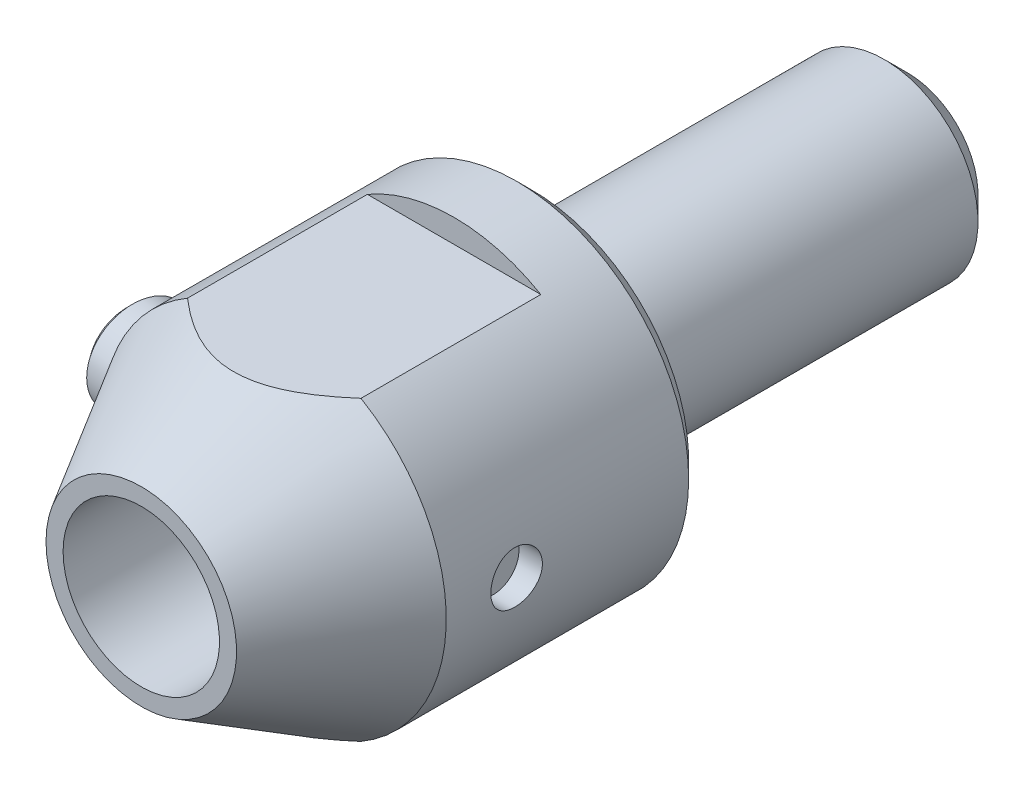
ISO-10303-21;
HEADER;
FILE_DESCRIPTION(('STEP AP214'),'2;1');
FILE_NAME('part.step','',(''),(''),'','','');
FILE_SCHEMA(('AUTOMOTIVE_DESIGN { 1 0 10303 214 1 1 1 1 }'));
ENDSEC;
DATA;
#1=APPLICATION_CONTEXT('core data for automotive mechanical design processes');
#2=APPLICATION_PROTOCOL_DEFINITION('international standard','automotive_design',2000,#1);
#3=PRODUCT_CONTEXT('',#1,'mechanical');
#4=PRODUCT('Part','Part','',(#3));
#5=PRODUCT_RELATED_PRODUCT_CATEGORY('part','',(#4));
#6=PRODUCT_DEFINITION_FORMATION('','',#4);
#7=PRODUCT_DEFINITION_CONTEXT('part definition',#1,'design');
#8=PRODUCT_DEFINITION('design','',#6,#7);
#9=PRODUCT_DEFINITION_SHAPE('','',#8);
#10=(LENGTH_UNIT() NAMED_UNIT(*) SI_UNIT(.MILLI.,.METRE.));
#11=(NAMED_UNIT(*) PLANE_ANGLE_UNIT() SI_UNIT($,.RADIAN.));
#12=(NAMED_UNIT(*) SI_UNIT($,.STERADIAN.) SOLID_ANGLE_UNIT());
#13=UNCERTAINTY_MEASURE_WITH_UNIT(LENGTH_MEASURE(1.E-05),#10,'distance_accuracy_value','');
#14=(GEOMETRIC_REPRESENTATION_CONTEXT(3) GLOBAL_UNCERTAINTY_ASSIGNED_CONTEXT((#13)) GLOBAL_UNIT_ASSIGNED_CONTEXT((#10,
#11,#12)) REPRESENTATION_CONTEXT('',''));
#15=CARTESIAN_POINT('',(0.,0.,0.));
#16=DIRECTION('',(0.,0.,1.));
#17=DIRECTION('',(1.,0.,0.));
#18=AXIS2_PLACEMENT_3D('',#15,#16,#17);
#19=CARTESIAN_POINT('',(0.,0.,-48.3091160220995));
#20=DIRECTION('',(0.,0.,-1.));
#21=DIRECTION('',(-1.,0.,0.));
#22=AXIS2_PLACEMENT_3D('',#19,#20,#21);
#23=CYLINDRICAL_SURFACE('',#22,11.);
#24=CARTESIAN_POINT('',(0.,0.,1.));
#25=DIRECTION('',(0.,0.,-1.));
#26=DIRECTION('',(-1.,0.,0.));
#27=AXIS2_PLACEMENT_3D('',#24,#25,#26);
#28=CIRCLE('',#27,11.);
#29=CARTESIAN_POINT('',(-11.,0.,1.));
#30=VERTEX_POINT('',#29);
#31=EDGE_CURVE('E263',#30,#30,#28,.T.);
#32=ORIENTED_EDGE('',*,*,#31,.F.);
#33=EDGE_LOOP('',(#32));
#34=FACE_BOUND('',#33,.T.);
#35=CARTESIAN_POINT('',(11.,0.,13.65));
#36=CARTESIAN_POINT('',(10.9999985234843,0.0921266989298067,13.6499962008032));
#37=CARTESIAN_POINT('',(10.9988305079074,0.184306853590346,13.6422581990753));
#38=CARTESIAN_POINT('',(10.9942834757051,0.366090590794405,13.611518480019));
#39=CARTESIAN_POINT('',(10.9909023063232,0.455691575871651,13.5885019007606));
#40=CARTESIAN_POINT('',(10.9823089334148,0.629659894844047,13.5279082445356));
#41=CARTESIAN_POINT('',(10.9770981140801,0.714031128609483,13.4903421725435));
#42=CARTESIAN_POINT('',(10.965421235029,0.875259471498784,13.4017427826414));
#43=CARTESIAN_POINT('',(10.9589553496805,0.952117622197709,13.3507113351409));
#44=CARTESIAN_POINT('',(10.945430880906,1.09675139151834,13.2362050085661));
#45=CARTESIAN_POINT('',(10.9383684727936,1.16445981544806,13.172645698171));
#46=CARTESIAN_POINT('',(10.9244768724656,1.28829239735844,13.0350695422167));
#47=CARTESIAN_POINT('',(10.9176476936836,1.34441588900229,12.9610520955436));
#48=CARTESIAN_POINT('',(10.904958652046,1.44374702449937,12.8042092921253));
#49=CARTESIAN_POINT('',(10.8991037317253,1.48688965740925,12.7213423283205));
#50=CARTESIAN_POINT('',(10.8890783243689,1.55861895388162,12.54943589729));
#51=CARTESIAN_POINT('',(10.8849077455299,1.58720641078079,12.4603967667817));
#52=CARTESIAN_POINT('',(10.8787608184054,1.62880518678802,12.2793801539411));
#53=CARTESIAN_POINT('',(10.8767682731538,1.64193154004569,12.1874296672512));
#54=CARTESIAN_POINT('',(10.8751538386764,1.65259186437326,12.002611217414));
#55=CARTESIAN_POINT('',(10.8755318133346,1.65012673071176,11.9097433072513));
#56=CARTESIAN_POINT('',(10.8786009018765,1.62976806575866,11.7265388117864));
#57=CARTESIAN_POINT('',(10.881272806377,1.61200265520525,11.6361876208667));
#58=CARTESIAN_POINT('',(10.88859868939,1.56174829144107,11.4597631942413));
#59=CARTESIAN_POINT('',(10.8932527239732,1.52925892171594,11.3736900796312));
#60=CARTESIAN_POINT('',(10.9040396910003,1.4503456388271,11.2078752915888));
#61=CARTESIAN_POINT('',(10.9101783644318,1.40386745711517,11.1281598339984));
#62=CARTESIAN_POINT('',(10.92323878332,1.2983345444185,10.9776109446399));
#63=CARTESIAN_POINT('',(10.9301605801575,1.23927898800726,10.9067780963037));
#64=CARTESIAN_POINT('',(10.9440922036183,1.10956442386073,10.7752625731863));
#65=CARTESIAN_POINT('',(10.951102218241,1.0387952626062,10.714688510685));
#66=CARTESIAN_POINT('',(10.9643561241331,0.888037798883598,10.606260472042));
#67=CARTESIAN_POINT('',(10.9706000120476,0.808049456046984,10.5584065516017));
#68=CARTESIAN_POINT('',(10.9816246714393,0.641030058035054,10.4767716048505));
#69=CARTESIAN_POINT('',(10.9864045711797,0.553994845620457,10.4429989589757));
#70=CARTESIAN_POINT('',(10.9939553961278,0.375400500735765,10.3905796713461));
#71=CARTESIAN_POINT('',(10.9967264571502,0.28384167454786,10.3719320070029));
#72=CARTESIAN_POINT('',(10.9999293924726,0.0997365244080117,10.3504364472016));
#73=CARTESIAN_POINT('',(11.0003833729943,0.00720800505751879,10.3474392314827));
#74=CARTESIAN_POINT('',(10.9989611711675,-0.177030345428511,10.3569333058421));
#75=CARTESIAN_POINT('',(10.9970850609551,-0.268740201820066,10.3694241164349));
#76=CARTESIAN_POINT('',(10.9912271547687,-0.448285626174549,10.4094155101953));
#77=CARTESIAN_POINT('',(10.9872555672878,-0.536137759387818,10.4368433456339));
#78=CARTESIAN_POINT('',(10.9776505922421,-0.705996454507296,10.5058534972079));
#79=CARTESIAN_POINT('',(10.9720171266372,-0.78800274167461,10.547436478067));
#80=CARTESIAN_POINT('',(10.9596595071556,-0.944498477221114,10.6439268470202));
#81=CARTESIAN_POINT('',(10.9529277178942,-1.01892891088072,10.698928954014));
#82=CARTESIAN_POINT('',(10.9391464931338,-1.15755604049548,10.8205643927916));
#83=CARTESIAN_POINT('',(10.9320970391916,-1.22175214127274,10.8871984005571));
#84=CARTESIAN_POINT('',(10.9184049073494,-1.33863163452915,11.0308708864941));
#85=CARTESIAN_POINT('',(10.9117660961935,-1.39121493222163,11.1079912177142));
#86=CARTESIAN_POINT('',(10.8997154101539,-1.48268042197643,11.2700576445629));
#87=CARTESIAN_POINT('',(10.8943035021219,-1.5215629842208,11.3550035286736));
#88=CARTESIAN_POINT('',(10.8853473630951,-1.58436814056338,11.5300112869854));
#89=CARTESIAN_POINT('',(10.8817965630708,-1.60834340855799,11.6200539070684));
#90=CARTESIAN_POINT('',(10.8769472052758,-1.64082104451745,11.8029449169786));
#91=CARTESIAN_POINT('',(10.8756484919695,-1.64932448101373,11.8957931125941));
#92=CARTESIAN_POINT('',(10.8754561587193,-1.65059165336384,12.0806619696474));
#93=CARTESIAN_POINT('',(10.8765384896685,-1.64351277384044,12.1726815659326));
#94=CARTESIAN_POINT('',(10.8809340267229,-1.61415352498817,12.3542057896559));
#95=CARTESIAN_POINT('',(10.8842472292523,-1.5918731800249,12.4437104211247));
#96=CARTESIAN_POINT('',(10.8927227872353,-1.53279910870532,12.6176203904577));
#97=CARTESIAN_POINT('',(10.8978837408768,-1.49601638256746,12.7020295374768));
#98=CARTESIAN_POINT('',(10.9094750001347,-1.4089973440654,12.8635039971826));
#99=CARTESIAN_POINT('',(10.91590534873,-1.35876057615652,12.940569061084));
#100=CARTESIAN_POINT('',(10.9293881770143,-1.2456877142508,13.0859673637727));
#101=CARTESIAN_POINT('',(10.9364460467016,-1.18273505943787,13.1542094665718));
#102=CARTESIAN_POINT('',(10.950343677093,-1.04626372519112,13.2792170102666));
#103=CARTESIAN_POINT('',(10.9571833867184,-0.972742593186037,13.3359797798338));
#104=CARTESIAN_POINT('',(10.9699170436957,-0.816745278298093,13.4366964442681));
#105=CARTESIAN_POINT('',(10.975805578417,-0.734222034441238,13.4805781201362));
#106=CARTESIAN_POINT('',(10.9859203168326,-0.562927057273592,13.5537923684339));
#107=CARTESIAN_POINT('',(10.9901482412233,-0.474161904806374,13.5831400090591));
#108=CARTESIAN_POINT('',(10.9955003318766,-0.32083230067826,13.6197954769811));
#109=CARTESIAN_POINT('',(10.9971790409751,-0.257214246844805,13.6311048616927));
#110=CARTESIAN_POINT('',(10.9994293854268,-0.129072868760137,13.6462084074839));
#111=CARTESIAN_POINT('',(11.0000010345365,-0.0645495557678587,13.6500026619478));
#112=CARTESIAN_POINT('',(11.,0.,13.65));
#113=B_SPLINE_CURVE_WITH_KNOTS('',3,(#35,#36,#37,#38,#39,#40,#41,#42,#43,#44,#45,#46,#47,#48,
#49,#50,#51,#52,#53,#54,#55,#56,#57,#58,#59,#60,#61,#62,#63,#64,#65,#66,#67,#68,#69,#70,#71,#72,
#73,#74,#75,#76,#77,#78,#79,#80,#81,#82,#83,#84,#85,#86,#87,#88,#89,#90,#91,#92,#93,#94,#95,#96,
#97,#98,#99,#100,#101,#102,#103,#104,#105,#106,#107,#108,#109,#110,#111,#112),.UNSPECIFIED.,.T.,
.F.,(4,2,2,2,2,2,2,2,2,2,2,2,2,2,2,2,2,2,2,2,2,2,2,2,2,2,2,2,2,2,2,2,2,2,2,2,2,2,4),(0.,
0.27614422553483,0.552557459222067,0.828762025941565,1.10492824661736,1.38302357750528,
1.66113489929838,1.94061672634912,2.22008331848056,2.49745721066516,2.7748151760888,
3.04987294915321,3.32493850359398,3.60108521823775,3.87725006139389,4.1561772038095,
4.43510556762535,4.71419969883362,4.99327495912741,5.2696826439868,5.5460817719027,
5.82114663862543,6.09622442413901,6.37330306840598,6.65039782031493,6.92979503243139,
7.20918469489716,7.48758145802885,7.76595899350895,8.0415377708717,8.31711610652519,
8.5924858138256,8.86786484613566,9.14589312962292,9.42398603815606,9.70360955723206,
9.98294256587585,10.1764283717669,10.3699117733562),.UNSPECIFIED.);
#114=CARTESIAN_POINT('',(11.,0.,13.65));
#115=VERTEX_POINT('',#114);
#116=EDGE_CURVE('E182',#115,#115,#113,.T.);
#117=ORIENTED_EDGE('',*,*,#116,.T.);
#118=EDGE_LOOP('',(#117));
#119=FACE_BOUND('',#118,.T.);
#120=CARTESIAN_POINT('',(0.,0.,16.5));
#121=DIRECTION('',(0.,0.,-1.));
#122=DIRECTION('',(-1.,0.,0.));
#123=AXIS2_PLACEMENT_3D('',#120,#121,#122);
#124=CIRCLE('',#123,11.);
#125=CARTESIAN_POINT('',(5.54526825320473,9.5,16.5));
#126=VERTEX_POINT('',#125);
#127=CARTESIAN_POINT('',(5.54526825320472,-9.5,16.5));
#128=VERTEX_POINT('',#127);
#129=EDGE_CURVE('E268',#126,#128,#124,.T.);
#130=ORIENTED_EDGE('',*,*,#129,.T.);
#131=DIRECTION('',(0.,0.,-1.));
#132=VECTOR('',#131,1.);
#133=CARTESIAN_POINT('',(5.54526825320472,-9.5,-48.3091160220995));
#134=LINE('',#133,#132);
#135=CARTESIAN_POINT('',(5.54526825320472,-9.5,5.));
#136=VERTEX_POINT('',#135);
#137=EDGE_CURVE('E36',#128,#136,#134,.T.);
#138=ORIENTED_EDGE('',*,*,#137,.T.);
#139=CARTESIAN_POINT('',(0.,0.,5.));
#140=DIRECTION('',(0.,0.,1.));
#141=DIRECTION('',(1.,0.,0.));
#142=AXIS2_PLACEMENT_3D('',#139,#140,#141);
#143=CIRCLE('',#142,11.);
#144=CARTESIAN_POINT('',(-5.54526825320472,-9.5,5.));
#145=VERTEX_POINT('',#144);
#146=EDGE_CURVE('E238',#145,#136,#143,.T.);
#147=ORIENTED_EDGE('',*,*,#146,.F.);
#148=DIRECTION('',(0.,0.,-1.));
#149=VECTOR('',#148,1.);
#150=CARTESIAN_POINT('',(-5.54526825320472,-9.5,-48.3091160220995));
#151=LINE('',#150,#149);
#152=CARTESIAN_POINT('',(-5.54526825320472,-9.5,16.5));
#153=VERTEX_POINT('',#152);
#154=EDGE_CURVE('E171',#145,#153,#151,.F.);
#155=ORIENTED_EDGE('',*,*,#154,.T.);
#156=CARTESIAN_POINT('',(-5.54526825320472,9.5,16.5));
#157=VERTEX_POINT('',#156);
#158=EDGE_CURVE('E44',#153,#157,#124,.T.);
#159=ORIENTED_EDGE('',*,*,#158,.T.);
#160=DIRECTION('',(0.,0.,-1.));
#161=VECTOR('',#160,1.);
#162=CARTESIAN_POINT('',(-5.54526825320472,9.5,-48.3091160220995));
#163=LINE('',#162,#161);
#164=CARTESIAN_POINT('',(-5.54526825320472,9.5,5.));
#165=VERTEX_POINT('',#164);
#166=EDGE_CURVE('E180',#157,#165,#163,.T.);
#167=ORIENTED_EDGE('',*,*,#166,.T.);
#168=CARTESIAN_POINT('',(0.,0.,5.));
#169=DIRECTION('',(0.,0.,1.));
#170=DIRECTION('',(1.,0.,0.));
#171=AXIS2_PLACEMENT_3D('',#168,#169,#170);
#172=CIRCLE('',#171,11.);
#173=CARTESIAN_POINT('',(5.54526825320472,9.5,5.));
#174=VERTEX_POINT('',#173);
#175=EDGE_CURVE('E239',#174,#165,#172,.T.);
#176=ORIENTED_EDGE('',*,*,#175,.F.);
#177=DIRECTION('',(0.,0.,-1.));
#178=VECTOR('',#177,1.);
#179=CARTESIAN_POINT('',(5.54526825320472,9.5,-48.3091160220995));
#180=LINE('',#179,#178);
#181=EDGE_CURVE('E177',#174,#126,#180,.F.);
#182=ORIENTED_EDGE('',*,*,#181,.T.);
#183=EDGE_LOOP('',(#130,#138,#147,#155,#159,#167,#176,#182));
#184=FACE_BOUND('',#183,.T.);
#185=CARTESIAN_POINT('',(-11.,0.,15.0294827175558));
#186=CARTESIAN_POINT('',(-10.9999973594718,0.167992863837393,15.0294792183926));
#187=CARTESIAN_POINT('',(-10.9961146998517,0.336028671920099,15.0157376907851));
#188=CARTESIAN_POINT('',(-10.9809927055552,0.667340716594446,14.9611240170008));
#189=CARTESIAN_POINT('',(-10.969750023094,0.830614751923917,14.9202395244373));
#190=CARTESIAN_POINT('',(-10.9411247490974,1.14765891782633,14.8124431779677));
#191=CARTESIAN_POINT('',(-10.9237454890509,1.30143415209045,14.7455454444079));
#192=CARTESIAN_POINT('',(-10.8847121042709,1.59531875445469,14.5874220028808));
#193=CARTESIAN_POINT('',(-10.863058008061,1.73542821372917,14.4961964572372));
#194=CARTESIAN_POINT('',(-10.8176869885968,1.99891206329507,14.2910681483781));
#195=CARTESIAN_POINT('',(-10.7939586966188,2.12218332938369,14.1770353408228));
#196=CARTESIAN_POINT('',(-10.7472069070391,2.34751290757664,13.9295127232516));
#197=CARTESIAN_POINT('',(-10.7241833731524,2.44957231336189,13.7960239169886));
#198=CARTESIAN_POINT('',(-10.6816440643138,2.62886756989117,13.5141058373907));
#199=CARTESIAN_POINT('',(-10.6621051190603,2.70627030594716,13.3657863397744));
#200=CARTESIAN_POINT('',(-10.6286247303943,2.83492292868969,13.0576348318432));
#201=CARTESIAN_POINT('',(-10.6146821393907,2.88617817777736,12.8978051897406));
#202=CARTESIAN_POINT('',(-10.5942386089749,2.96033197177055,12.5750816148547));
#203=CARTESIAN_POINT('',(-10.5875764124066,2.98384595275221,12.4123388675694));
#204=CARTESIAN_POINT('',(-10.5817908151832,3.00429993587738,12.0850769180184));
#205=CARTESIAN_POINT('',(-10.5826675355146,3.00123951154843,11.9205576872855));
#206=CARTESIAN_POINT('',(-10.5917267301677,2.96910615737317,11.5938223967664));
#207=CARTESIAN_POINT('',(-10.599931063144,2.93995539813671,11.4316147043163));
#208=CARTESIAN_POINT('',(-10.6226315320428,2.8568400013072,11.1141537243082));
#209=CARTESIAN_POINT('',(-10.6371291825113,2.80286939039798,10.9589021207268));
#210=CARTESIAN_POINT('',(-10.6715664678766,2.66883031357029,10.6522412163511));
#211=CARTESIAN_POINT('',(-10.6917229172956,2.58769014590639,10.5013247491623));
#212=CARTESIAN_POINT('',(-10.7348971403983,2.40229511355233,10.2148429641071));
#213=CARTESIAN_POINT('',(-10.7579158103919,2.29803300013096,10.0792824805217));
#214=CARTESIAN_POINT('',(-10.8052404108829,2.06434157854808,9.82219485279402));
#215=CARTESIAN_POINT('',(-10.82956182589,1.9340994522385,9.70140667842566));
#216=CARTESIAN_POINT('',(-10.8758100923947,1.65433055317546,9.48408743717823));
#217=CARTESIAN_POINT('',(-10.8977372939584,1.50480660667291,9.38755282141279));
#218=CARTESIAN_POINT('',(-10.9360173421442,1.19467088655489,9.22471423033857));
#219=CARTESIAN_POINT('',(-10.9525059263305,1.03447280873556,9.15765747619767));
#220=CARTESIAN_POINT('',(-10.9786813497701,0.704211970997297,9.05301986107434));
#221=CARTESIAN_POINT('',(-10.9883721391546,0.534155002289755,9.01542188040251));
#222=CARTESIAN_POINT('',(-10.9993101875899,0.202031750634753,8.97311226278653));
#223=CARTESIAN_POINT('',(-11.0011077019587,0.0402545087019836,8.96625672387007));
#224=CARTESIAN_POINT('',(-10.9975635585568,-0.282045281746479,8.97988635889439));
#225=CARTESIAN_POINT('',(-10.9922231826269,-0.442568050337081,9.00036662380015));
#226=CARTESIAN_POINT('',(-10.9752915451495,-0.752555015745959,9.06664412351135));
#227=CARTESIAN_POINT('',(-10.9639040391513,-0.9022084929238,9.11161727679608));
#228=CARTESIAN_POINT('',(-10.9361871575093,-1.19207076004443,9.22453482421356));
#229=CARTESIAN_POINT('',(-10.9198569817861,-1.33227801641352,9.29248293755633));
#230=CARTESIAN_POINT('',(-10.8830996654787,-1.60559765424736,9.45226451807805));
#231=CARTESIAN_POINT('',(-10.8625322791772,-1.73818533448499,9.54496121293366));
#232=CARTESIAN_POINT('',(-10.8197935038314,-1.98696548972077,9.74992459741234));
#233=CARTESIAN_POINT('',(-10.7976215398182,-2.10315204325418,9.86219832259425));
#234=CARTESIAN_POINT('',(-10.7522793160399,-2.32424363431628,10.11178267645));
#235=CARTESIAN_POINT('',(-10.7291463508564,-2.42780893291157,10.2502891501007));
#236=CARTESIAN_POINT('',(-10.6860145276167,-2.61112791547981,10.5427309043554));
#237=CARTESIAN_POINT('',(-10.6660163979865,-2.69087606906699,10.6966697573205));
#238=CARTESIAN_POINT('',(-10.6309958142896,-2.82612274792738,11.0204028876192));
#239=CARTESIAN_POINT('',(-10.6161225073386,-2.8809073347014,11.1905133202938));
#240=CARTESIAN_POINT('',(-10.5941133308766,-2.96083005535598,11.5380477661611));
#241=CARTESIAN_POINT('',(-10.5869750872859,-2.98597728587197,11.7154695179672));
#242=CARTESIAN_POINT('',(-10.5816506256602,-3.00478942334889,12.0652953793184));
#243=CARTESIAN_POINT('',(-10.5831315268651,-2.99962493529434,12.2376309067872));
#244=CARTESIAN_POINT('',(-10.5942484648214,-2.96012142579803,12.5786463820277));
#245=CARTESIAN_POINT('',(-10.6038823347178,-2.92579015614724,12.7473272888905));
#246=CARTESIAN_POINT('',(-10.6296035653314,-2.83086555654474,13.0684623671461));
#247=CARTESIAN_POINT('',(-10.6453882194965,-2.77149463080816,13.2213039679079));
#248=CARTESIAN_POINT('',(-10.6816144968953,-2.62840862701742,13.5145231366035));
#249=CARTESIAN_POINT('',(-10.7020561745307,-2.54469326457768,13.6549005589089));
#250=CARTESIAN_POINT('',(-10.7453530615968,-2.35516765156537,13.9196472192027));
#251=CARTESIAN_POINT('',(-10.7682109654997,-2.24933260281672,14.0439982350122));
#252=CARTESIAN_POINT('',(-10.8138540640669,-2.0185086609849,14.2734739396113));
#253=CARTESIAN_POINT('',(-10.8366392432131,-1.89351592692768,14.3785947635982));
#254=CARTESIAN_POINT('',(-10.8802258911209,-1.62469056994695,14.5692331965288));
#255=CARTESIAN_POINT('',(-10.9009706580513,-1.48049499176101,14.6542522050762));
#256=CARTESIAN_POINT('',(-10.9376212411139,-1.17956213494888,14.7993987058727));
#257=CARTESIAN_POINT('',(-10.9535291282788,-1.02283026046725,14.8595368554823));
#258=CARTESIAN_POINT('',(-10.9771415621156,-0.72248592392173,14.9472115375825));
#259=CARTESIAN_POINT('',(-10.9856525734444,-0.579878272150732,14.9780069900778));
#260=CARTESIAN_POINT('',(-10.9970828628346,-0.291524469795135,15.0191438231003));
#261=CARTESIAN_POINT('',(-11.0000022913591,-0.145778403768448,15.0294857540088));
#262=CARTESIAN_POINT('',(-11.,0.,15.0294827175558));
#263=B_SPLINE_CURVE_WITH_KNOTS('',3,(#185,#186,#187,#188,#189,#190,#191,#192,#193,#194,#195,
#196,#197,#198,#199,#200,#201,#202,#203,#204,#205,#206,#207,#208,#209,#210,#211,#212,#213,#214,
#215,#216,#217,#218,#219,#220,#221,#222,#223,#224,#225,#226,#227,#228,#229,#230,#231,#232,#233,
#234,#235,#236,#237,#238,#239,#240,#241,#242,#243,#244,#245,#246,#247,#248,#249,#250,#251,#252,
#253,#254,#255,#256,#257,#258,#259,#260,#261,#262),.UNSPECIFIED.,.T.,.F.,(4,2,2,2,2,2,2,2,2,2,2,
2,2,2,2,2,2,2,2,2,2,2,2,2,2,2,2,2,2,2,2,2,2,2,2,2,2,2,4),(0.,0.503453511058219,1.00713618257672,
1.51054582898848,2.01395211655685,2.52031508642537,3.02665194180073,3.52948508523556,
4.03221506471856,4.52356879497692,5.01493041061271,5.50776269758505,6.00071365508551,
6.51600043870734,7.0314489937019,7.56669493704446,8.10186251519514,8.62243226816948,
9.14269927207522,9.6260555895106,10.1093251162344,10.5772576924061,11.0452660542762,
11.5324154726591,12.0197403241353,12.5408358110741,13.0620522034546,13.5973608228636,
14.1325050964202,14.6471221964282,15.1616025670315,15.6534386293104,16.145280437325,
16.6376766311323,17.1301716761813,17.6338350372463,18.1372824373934,18.5741737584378,
19.0110533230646),.UNSPECIFIED.);
#264=CARTESIAN_POINT('',(-11.,0.,15.0294827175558));
#265=VERTEX_POINT('',#264);
#266=EDGE_CURVE('E10',#265,#265,#263,.T.);
#267=ORIENTED_EDGE('',*,*,#266,.F.);
#268=EDGE_LOOP('',(#267));
#269=FACE_BOUND('',#268,.T.);
#270=ADVANCED_FACE('F16',(#34,#119,#184,#269),#23,.T.);
#271=CARTESIAN_POINT('',(-19.1508082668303,0.,12.));
#272=DIRECTION('',(-1.,0.,0.));
#273=DIRECTION('',(0.,0.,1.));
#274=AXIS2_PLACEMENT_3D('',#271,#272,#273);
#275=CYLINDRICAL_SURFACE('',#274,1.65);
#276=ORIENTED_EDGE('',*,*,#116,.F.);
#277=EDGE_LOOP('',(#276));
#278=FACE_BOUND('',#277,.T.);
#279=CARTESIAN_POINT('',(9.5,0.,12.));
#280=DIRECTION('',(-1.,0.,0.));
#281=DIRECTION('',(0.,0.,1.));
#282=AXIS2_PLACEMENT_3D('',#279,#280,#281);
#283=CIRCLE('',#282,1.65);
#284=CARTESIAN_POINT('',(9.5,0.,13.65));
#285=VERTEX_POINT('',#284);
#286=EDGE_CURVE('E29',#285,#285,#283,.F.);
#287=ORIENTED_EDGE('',*,*,#286,.F.);
#288=EDGE_LOOP('',(#287));
#289=FACE_BOUND('',#288,.T.);
#290=ADVANCED_FACE('F194',(#278,#289),#275,.F.);
#291=CARTESIAN_POINT('',(5.9,0.,0.));
#292=DIRECTION('',(0.,0.,1.));
#293=DIRECTION('',(1.,0.,0.));
#294=AXIS2_PLACEMENT_3D('',#291,#292,#293);
#295=PLANE('',#294);
#296=CARTESIAN_POINT('',(0.,0.,0.));
#297=DIRECTION('',(0.,0.,1.));
#298=DIRECTION('',(1.,0.,0.));
#299=AXIS2_PLACEMENT_3D('',#296,#297,#298);
#300=CIRCLE('',#299,6.);
#301=CARTESIAN_POINT('',(6.,0.,0.));
#302=VERTEX_POINT('',#301);
#303=EDGE_CURVE('E128',#302,#302,#300,.T.);
#304=ORIENTED_EDGE('',*,*,#303,.T.);
#305=EDGE_LOOP('',(#304));
#306=FACE_BOUND('',#305,.T.);
#307=CARTESIAN_POINT('',(0.,0.,0.));
#308=DIRECTION('',(0.,0.,-1.));
#309=DIRECTION('',(-1.,0.,0.));
#310=AXIS2_PLACEMENT_3D('',#307,#308,#309);
#311=CIRCLE('',#310,10.);
#312=CARTESIAN_POINT('',(-10.,0.,0.));
#313=VERTEX_POINT('',#312);
#314=EDGE_CURVE('E490',#313,#313,#311,.T.);
#315=ORIENTED_EDGE('',*,*,#314,.T.);
#316=EDGE_LOOP('',(#315));
#317=FACE_BOUND('',#316,.T.);
#318=ADVANCED_FACE('F199',(#306,#317),#295,.F.);
#319=CARTESIAN_POINT('',(0.,0.,1.));
#320=DIRECTION('',(0.,0.,1.));
#321=DIRECTION('',(1.,0.,0.));
#322=AXIS2_PLACEMENT_3D('',#319,#320,#321);
#323=CONICAL_SURFACE('',#322,11.,0.785398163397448);
#324=ORIENTED_EDGE('',*,*,#314,.F.);
#325=EDGE_LOOP('',(#324));
#326=FACE_BOUND('',#325,.T.);
#327=ORIENTED_EDGE('',*,*,#31,.T.);
#328=EDGE_LOOP('',(#327));
#329=FACE_BOUND('',#328,.T.);
#330=ADVANCED_FACE('F219',(#326,#329),#323,.T.);
#331=CARTESIAN_POINT('',(0.,0.,25.));
#332=DIRECTION('',(0.,0.,-1.));
#333=DIRECTION('',(-1.,0.,0.));
#334=AXIS2_PLACEMENT_3D('',#331,#332,#333);
#335=CONICAL_SURFACE('',#334,6.09252271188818,0.523598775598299);
#336=ORIENTED_EDGE('',*,*,#158,.F.);
#337=CARTESIAN_POINT('',(-14.1807249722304,-9.5,5.98857941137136));
#338=CARTESIAN_POINT('',(-13.8768260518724,-9.5,6.42580027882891));
#339=CARTESIAN_POINT('',(-13.570957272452,-9.5,6.86166688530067));
#340=CARTESIAN_POINT('',(-12.9542967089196,-9.5,7.73002507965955));
#341=CARTESIAN_POINT('',(-12.6435040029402,-9.5,8.16251601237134));
#342=CARTESIAN_POINT('',(-12.0135781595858,-9.5,9.02678684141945));
#343=CARTESIAN_POINT('',(-11.6943977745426,-9.5,9.45853241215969));
#344=CARTESIAN_POINT('',(-11.2102562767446,-9.5,10.1020679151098));
#345=CARTESIAN_POINT('',(-11.0479906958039,-9.5,10.3158863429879));
#346=CARTESIAN_POINT('',(-10.7214469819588,-9.5,10.7420012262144));
#347=CARTESIAN_POINT('',(-10.5571687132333,-9.5,10.9542975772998));
#348=CARTESIAN_POINT('',(-10.0298942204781,-9.5,11.6283733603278));
#349=CARTESIAN_POINT('',(-9.66268980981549,-9.5,12.0868947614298));
#350=CARTESIAN_POINT('',(-9.1016707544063,-9.5,12.766203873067));
#351=CARTESIAN_POINT('',(-8.91296879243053,-9.5,12.9912207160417));
#352=CARTESIAN_POINT('',(-8.53164884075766,-9.5,13.4379073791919));
#353=CARTESIAN_POINT('',(-8.33903097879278,-9.5,13.6595773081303));
#354=CARTESIAN_POINT('',(-7.94995458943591,-9.5,14.0981858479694));
#355=CARTESIAN_POINT('',(-7.75351131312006,-9.5,14.3151379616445));
#356=CARTESIAN_POINT('',(-7.3554449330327,-9.5,14.7442704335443));
#357=CARTESIAN_POINT('',(-7.15382158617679,-9.5,14.9564505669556));
#358=CARTESIAN_POINT('',(-6.74470174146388,-9.5,15.3748170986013));
#359=CARTESIAN_POINT('',(-6.53720915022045,-9.5,15.5810073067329));
#360=CARTESIAN_POINT('',(-6.11525103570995,-9.5,15.9861003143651));
#361=CARTESIAN_POINT('',(-5.90078670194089,-9.5,16.1850043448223));
#362=CARTESIAN_POINT('',(-5.56541970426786,-9.5,16.4831694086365));
#363=CARTESIAN_POINT('',(-5.44743488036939,-9.5,16.5857149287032));
#364=CARTESIAN_POINT('',(-5.2089203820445,-9.5,16.7878017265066));
#365=CARTESIAN_POINT('',(-5.08839066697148,-9.5,16.8873429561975));
#366=CARTESIAN_POINT('',(-4.72252674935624,-9.5,17.1809428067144));
#367=CARTESIAN_POINT('',(-4.47301948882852,-9.5,17.36988610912));
#368=CARTESIAN_POINT('',(-3.96391715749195,-9.5,17.7276535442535));
#369=CARTESIAN_POINT('',(-3.70446103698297,-9.5,17.896673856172));
#370=CARTESIAN_POINT('',(-3.17146086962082,-9.5,18.2108024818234));
#371=CARTESIAN_POINT('',(-2.89793068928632,-9.5,18.3559337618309));
#372=CARTESIAN_POINT('',(-2.46091900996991,-9.5,18.5569579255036));
#373=CARTESIAN_POINT('',(-2.30248845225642,-9.5,18.6238650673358));
#374=CARTESIAN_POINT('',(-1.98124278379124,-9.5,18.7462403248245));
#375=CARTESIAN_POINT('',(-1.81842817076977,-9.5,18.8017097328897));
#376=CARTESIAN_POINT('',(-1.48905448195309,-9.5,18.8995411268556));
#377=CARTESIAN_POINT('',(-1.32249938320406,-9.5,18.9419163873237));
#378=CARTESIAN_POINT('',(-0.98632776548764,-9.5,19.0121524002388));
#379=CARTESIAN_POINT('',(-0.816711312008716,-9.5,19.0400134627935));
#380=CARTESIAN_POINT('',(-0.474167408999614,-9.5,19.0802729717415));
#381=CARTESIAN_POINT('',(-0.301224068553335,-9.5,19.0925378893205));
#382=CARTESIAN_POINT('',(0.0450431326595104,-9.5,19.1006232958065));
#383=CARTESIAN_POINT('',(0.218366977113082,-9.5,19.096444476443));
#384=CARTESIAN_POINT('',(0.563901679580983,-9.5,19.0718271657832));
#385=CARTESIAN_POINT('',(0.736112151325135,-9.5,19.0513833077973));
#386=CARTESIAN_POINT('',(1.07799036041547,-9.5,18.9951061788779));
#387=CARTESIAN_POINT('',(1.24765770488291,-9.5,18.9592705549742));
#388=CARTESIAN_POINT('',(1.62039401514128,-9.5,18.8641231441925));
#389=CARTESIAN_POINT('',(1.82258481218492,-9.5,18.8013783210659));
#390=CARTESIAN_POINT('',(2.22051767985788,-9.5,18.6579368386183));
#391=CARTESIAN_POINT('',(2.41625608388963,-9.5,18.577230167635));
#392=CARTESIAN_POINT('',(2.80135172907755,-9.5,18.4006214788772));
#393=CARTESIAN_POINT('',(2.99068950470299,-9.5,18.3046774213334));
#394=CARTESIAN_POINT('',(3.3625031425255,-9.5,18.100452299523));
#395=CARTESIAN_POINT('',(3.54497958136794,-9.5,17.9921722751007));
#396=CARTESIAN_POINT('',(3.95802467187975,-9.5,17.731065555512));
#397=CARTESIAN_POINT('',(4.18635005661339,-9.5,17.5747033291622));
#398=CARTESIAN_POINT('',(4.63336973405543,-9.5,17.2487059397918));
#399=CARTESIAN_POINT('',(4.85205955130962,-9.5,17.0790647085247));
#400=CARTESIAN_POINT('',(5.28137303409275,-9.5,16.7291447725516));
#401=CARTESIAN_POINT('',(5.49198121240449,-9.5,16.5488471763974));
#402=CARTESIAN_POINT('',(5.9058352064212,-9.5,16.180097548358));
#403=CARTESIAN_POINT('',(6.10908215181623,-9.5,15.9916467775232));
#404=CARTESIAN_POINT('',(6.51191442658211,-9.5,15.6056407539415));
#405=CARTESIAN_POINT('',(6.71141553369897,-9.5,15.4079979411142));
#406=CARTESIAN_POINT('',(7.10483637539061,-9.5,15.0072384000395));
#407=CARTESIAN_POINT('',(7.29875592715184,-9.5,14.8041214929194));
#408=CARTESIAN_POINT('',(7.6815357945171,-9.5,14.3936291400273));
#409=CARTESIAN_POINT('',(7.87040174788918,-9.5,14.1862589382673));
#410=CARTESIAN_POINT('',(8.2439281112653,-9.5,13.7677883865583));
#411=CARTESIAN_POINT('',(8.4285886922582,-9.5,13.5566881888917));
#412=CARTESIAN_POINT('',(8.82675801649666,-9.5,13.0935174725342));
#413=CARTESIAN_POINT('',(9.03955684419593,-9.5,12.8408372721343));
#414=CARTESIAN_POINT('',(9.46078333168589,-9.5,12.3318544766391));
#415=CARTESIAN_POINT('',(9.66921084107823,-9.5,12.0755517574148));
#416=CARTESIAN_POINT('',(10.2888979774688,-9.5,11.3020493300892));
#417=CARTESIAN_POINT('',(10.6945067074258,-9.5,10.7803206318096));
#418=CARTESIAN_POINT('',(11.4944569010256,-9.5,9.72785731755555));
#419=CARTESIAN_POINT('',(11.8887914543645,-9.5,9.19711748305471));
#420=CARTESIAN_POINT('',(12.6684164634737,-9.5,8.12910682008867));
#421=CARTESIAN_POINT('',(13.0537075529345,-9.5,7.5918364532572));
#422=CARTESIAN_POINT('',(13.8181869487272,-9.5,6.5106836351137));
#423=CARTESIAN_POINT('',(14.197354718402,-9.5,5.96678669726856));
#424=CARTESIAN_POINT('',(14.9498309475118,-9.5,4.87494835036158));
#425=CARTESIAN_POINT('',(15.3231393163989,-9.5,4.32700687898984));
#426=CARTESIAN_POINT('',(16.0648034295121,-9.5,3.22806093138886));
#427=CARTESIAN_POINT('',(16.4331608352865,-9.5,2.67705757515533));
#428=CARTESIAN_POINT('',(17.1658551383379,-9.5,1.57238262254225));
#429=CARTESIAN_POINT('',(17.5301920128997,-9.5,1.01871101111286));
#430=CARTESIAN_POINT('',(18.5322186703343,-9.5,-0.51416738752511));
#431=CARTESIAN_POINT('',(19.1663520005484,-9.5,-1.49569874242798));
#432=CARTESIAN_POINT('',(20.4267610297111,-9.5,-3.46391775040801));
#433=CARTESIAN_POINT('',(21.0530359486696,-9.5,-4.45060590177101));
#434=CARTESIAN_POINT('',(22.296150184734,-9.5,-6.42266256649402));
#435=CARTESIAN_POINT('',(22.913021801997,-9.5,-7.40801073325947));
#436=CARTESIAN_POINT('',(23.8346607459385,-9.5,-8.88822948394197));
#437=CARTESIAN_POINT('',(24.1412435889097,-9.5,-9.38197141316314));
#438=CARTESIAN_POINT('',(24.7533175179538,-9.5,-10.3701302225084));
#439=CARTESIAN_POINT('',(25.0588086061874,-9.5,-10.8645471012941));
#440=CARTESIAN_POINT('',(25.3638135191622,-9.5,-11.3592638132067));
#441=B_SPLINE_CURVE_WITH_KNOTS('',3,(#337,#338,#339,#340,#341,#342,#343,#344,#345,#346,#347,
#348,#349,#350,#351,#352,#353,#354,#355,#356,#357,#358,#359,#360,#361,#362,#363,#364,#365,#366,
#367,#368,#369,#370,#371,#372,#373,#374,#375,#376,#377,#378,#379,#380,#381,#382,#383,#384,#385,
#386,#387,#388,#389,#390,#391,#392,#393,#394,#395,#396,#397,#398,#399,#400,#401,#402,#403,#404,
#405,#406,#407,#408,#409,#410,#411,#412,#413,#414,#415,#416,#417,#418,#419,#420,#421,#422,#423,
#424,#425,#426,#427,#428,#429,#430,#431,#432,#433,#434,#435,#436,#437,#438,#439,#440),
.UNSPECIFIED.,.F.,.F.,(4,2,2,2,2,2,2,2,2,2,2,2,2,2,2,2,2,2,2,2,2,2,2,2,2,2,2,2,2,2,2,2,2,2,2,2,
2,2,2,2,2,2,2,2,2,2,2,2,2,2,2,4),(0.,1.59740058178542,3.19510385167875,4.80578789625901,
5.61103158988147,6.41632992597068,8.17838822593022,9.05935862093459,9.94030032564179,
10.8182526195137,11.6962461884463,12.57366850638,13.4509418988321,13.9198572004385,
14.3887799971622,15.3270354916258,16.2551033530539,17.1822737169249,17.6978508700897,
18.2133697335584,18.7283642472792,19.2433477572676,19.7627113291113,20.2820530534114,
20.801566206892,21.3211588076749,21.9552457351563,22.5896869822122,23.2259100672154,
23.8620795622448,24.6916401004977,25.5215819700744,26.3530420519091,27.1843739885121,
28.026723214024,28.8690999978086,29.7104941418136,30.551854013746,31.5428413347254,
32.5338626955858,34.5161623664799,36.4996520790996,38.4830023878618,40.4720086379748,
42.4610455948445,44.4493974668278,46.4377605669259,49.9433789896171,53.4493426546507,
56.9368693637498,58.6804184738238,60.4239641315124),.UNSPECIFIED.);
#442=EDGE_CURVE('E231',#153,#128,#441,.T.);
#443=ORIENTED_EDGE('',*,*,#442,.T.);
#444=ORIENTED_EDGE('',*,*,#129,.F.);
#445=CARTESIAN_POINT('',(-14.1807249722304,9.5,5.98857941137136));
#446=CARTESIAN_POINT('',(-13.8768260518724,9.5,6.42580027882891));
#447=CARTESIAN_POINT('',(-13.570957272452,9.5,6.86166688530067));
#448=CARTESIAN_POINT('',(-12.9542967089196,9.5,7.73002507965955));
#449=CARTESIAN_POINT('',(-12.6435040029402,9.5,8.16251601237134));
#450=CARTESIAN_POINT('',(-12.0135781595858,9.5,9.02678684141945));
#451=CARTESIAN_POINT('',(-11.6943977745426,9.5,9.45853241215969));
#452=CARTESIAN_POINT('',(-11.2102562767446,9.5,10.1020679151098));
#453=CARTESIAN_POINT('',(-11.0479906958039,9.5,10.3158863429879));
#454=CARTESIAN_POINT('',(-10.7214469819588,9.5,10.7420012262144));
#455=CARTESIAN_POINT('',(-10.5571687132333,9.5,10.9542975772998));
#456=CARTESIAN_POINT('',(-10.0298942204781,9.5,11.6283733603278));
#457=CARTESIAN_POINT('',(-9.66268980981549,9.5,12.0868947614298));
#458=CARTESIAN_POINT('',(-9.1016707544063,9.5,12.766203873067));
#459=CARTESIAN_POINT('',(-8.91296879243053,9.5,12.9912207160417));
#460=CARTESIAN_POINT('',(-8.53164884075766,9.5,13.4379073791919));
#461=CARTESIAN_POINT('',(-8.33903097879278,9.5,13.6595773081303));
#462=CARTESIAN_POINT('',(-7.94995458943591,9.5,14.0981858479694));
#463=CARTESIAN_POINT('',(-7.75351131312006,9.5,14.3151379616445));
#464=CARTESIAN_POINT('',(-7.3554449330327,9.5,14.7442704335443));
#465=CARTESIAN_POINT('',(-7.15382158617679,9.5,14.9564505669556));
#466=CARTESIAN_POINT('',(-6.74470174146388,9.5,15.3748170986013));
#467=CARTESIAN_POINT('',(-6.53720915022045,9.5,15.5810073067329));
#468=CARTESIAN_POINT('',(-6.11525103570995,9.5,15.9861003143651));
#469=CARTESIAN_POINT('',(-5.90078670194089,9.5,16.1850043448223));
#470=CARTESIAN_POINT('',(-5.56541970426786,9.5,16.4831694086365));
#471=CARTESIAN_POINT('',(-5.44743488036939,9.5,16.5857149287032));
#472=CARTESIAN_POINT('',(-5.2089203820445,9.5,16.7878017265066));
#473=CARTESIAN_POINT('',(-5.08839066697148,9.5,16.8873429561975));
#474=CARTESIAN_POINT('',(-4.72252674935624,9.5,17.1809428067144));
#475=CARTESIAN_POINT('',(-4.47301948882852,9.5,17.36988610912));
#476=CARTESIAN_POINT('',(-3.96391715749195,9.5,17.7276535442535));
#477=CARTESIAN_POINT('',(-3.70446103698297,9.5,17.896673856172));
#478=CARTESIAN_POINT('',(-3.17146086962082,9.5,18.2108024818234));
#479=CARTESIAN_POINT('',(-2.89793068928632,9.5,18.3559337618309));
#480=CARTESIAN_POINT('',(-2.46091900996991,9.5,18.5569579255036));
#481=CARTESIAN_POINT('',(-2.30248845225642,9.5,18.6238650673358));
#482=CARTESIAN_POINT('',(-1.98124278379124,9.5,18.7462403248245));
#483=CARTESIAN_POINT('',(-1.81842817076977,9.5,18.8017097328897));
#484=CARTESIAN_POINT('',(-1.48905448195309,9.5,18.8995411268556));
#485=CARTESIAN_POINT('',(-1.32249938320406,9.5,18.9419163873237));
#486=CARTESIAN_POINT('',(-0.98632776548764,9.5,19.0121524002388));
#487=CARTESIAN_POINT('',(-0.816711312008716,9.5,19.0400134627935));
#488=CARTESIAN_POINT('',(-0.474167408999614,9.5,19.0802729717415));
#489=CARTESIAN_POINT('',(-0.301224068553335,9.5,19.0925378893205));
#490=CARTESIAN_POINT('',(0.0450431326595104,9.5,19.1006232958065));
#491=CARTESIAN_POINT('',(0.218366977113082,9.5,19.096444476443));
#492=CARTESIAN_POINT('',(0.563901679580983,9.5,19.0718271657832));
#493=CARTESIAN_POINT('',(0.736112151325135,9.5,19.0513833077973));
#494=CARTESIAN_POINT('',(1.07799036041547,9.5,18.9951061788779));
#495=CARTESIAN_POINT('',(1.24765770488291,9.5,18.9592705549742));
#496=CARTESIAN_POINT('',(1.62039401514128,9.5,18.8641231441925));
#497=CARTESIAN_POINT('',(1.82258481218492,9.5,18.8013783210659));
#498=CARTESIAN_POINT('',(2.22051767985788,9.5,18.6579368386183));
#499=CARTESIAN_POINT('',(2.41625608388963,9.5,18.577230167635));
#500=CARTESIAN_POINT('',(2.80135172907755,9.5,18.4006214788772));
#501=CARTESIAN_POINT('',(2.99068950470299,9.5,18.3046774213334));
#502=CARTESIAN_POINT('',(3.3625031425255,9.5,18.100452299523));
#503=CARTESIAN_POINT('',(3.54497958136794,9.5,17.9921722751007));
#504=CARTESIAN_POINT('',(3.95802467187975,9.5,17.731065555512));
#505=CARTESIAN_POINT('',(4.18635005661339,9.5,17.5747033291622));
#506=CARTESIAN_POINT('',(4.63336973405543,9.5,17.2487059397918));
#507=CARTESIAN_POINT('',(4.85205955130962,9.5,17.0790647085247));
#508=CARTESIAN_POINT('',(5.28137303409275,9.5,16.7291447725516));
#509=CARTESIAN_POINT('',(5.49198121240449,9.5,16.5488471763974));
#510=CARTESIAN_POINT('',(5.9058352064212,9.5,16.180097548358));
#511=CARTESIAN_POINT('',(6.10908215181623,9.5,15.9916467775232));
#512=CARTESIAN_POINT('',(6.51191442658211,9.5,15.6056407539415));
#513=CARTESIAN_POINT('',(6.71141553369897,9.5,15.4079979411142));
#514=CARTESIAN_POINT('',(7.10483637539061,9.5,15.0072384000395));
#515=CARTESIAN_POINT('',(7.29875592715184,9.5,14.8041214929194));
#516=CARTESIAN_POINT('',(7.6815357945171,9.5,14.3936291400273));
#517=CARTESIAN_POINT('',(7.87040174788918,9.5,14.1862589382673));
#518=CARTESIAN_POINT('',(8.2439281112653,9.5,13.7677883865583));
#519=CARTESIAN_POINT('',(8.4285886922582,9.5,13.5566881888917));
#520=CARTESIAN_POINT('',(8.82675801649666,9.5,13.0935174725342));
#521=CARTESIAN_POINT('',(9.03955684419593,9.5,12.8408372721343));
#522=CARTESIAN_POINT('',(9.46078333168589,9.5,12.3318544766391));
#523=CARTESIAN_POINT('',(9.66921084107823,9.5,12.0755517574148));
#524=CARTESIAN_POINT('',(10.2888979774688,9.5,11.3020493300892));
#525=CARTESIAN_POINT('',(10.6945067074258,9.5,10.7803206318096));
#526=CARTESIAN_POINT('',(11.4944569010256,9.5,9.72785731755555));
#527=CARTESIAN_POINT('',(11.8887914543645,9.5,9.19711748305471));
#528=CARTESIAN_POINT('',(12.6684164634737,9.5,8.12910682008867));
#529=CARTESIAN_POINT('',(13.0537075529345,9.5,7.5918364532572));
#530=CARTESIAN_POINT('',(13.8181869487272,9.5,6.5106836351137));
#531=CARTESIAN_POINT('',(14.197354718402,9.5,5.96678669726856));
#532=CARTESIAN_POINT('',(14.9498309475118,9.5,4.87494835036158));
#533=CARTESIAN_POINT('',(15.3231393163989,9.5,4.32700687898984));
#534=CARTESIAN_POINT('',(16.0648034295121,9.5,3.22806093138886));
#535=CARTESIAN_POINT('',(16.4331608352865,9.5,2.67705757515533));
#536=CARTESIAN_POINT('',(17.1658551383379,9.5,1.57238262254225));
#537=CARTESIAN_POINT('',(17.5301920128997,9.5,1.01871101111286));
#538=CARTESIAN_POINT('',(18.5322186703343,9.5,-0.51416738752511));
#539=CARTESIAN_POINT('',(19.1663520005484,9.5,-1.49569874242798));
#540=CARTESIAN_POINT('',(20.4267610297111,9.5,-3.46391775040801));
#541=CARTESIAN_POINT('',(21.0530359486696,9.5,-4.45060590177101));
#542=CARTESIAN_POINT('',(22.296150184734,9.5,-6.42266256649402));
#543=CARTESIAN_POINT('',(22.913021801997,9.5,-7.40801073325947));
#544=CARTESIAN_POINT('',(23.8346607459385,9.5,-8.88822948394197));
#545=CARTESIAN_POINT('',(24.1412435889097,9.5,-9.38197141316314));
#546=CARTESIAN_POINT('',(24.7533175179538,9.5,-10.3701302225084));
#547=CARTESIAN_POINT('',(25.0588086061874,9.5,-10.8645471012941));
#548=CARTESIAN_POINT('',(25.3638135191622,9.5,-11.3592638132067));
#549=B_SPLINE_CURVE_WITH_KNOTS('',3,(#445,#446,#447,#448,#449,#450,#451,#452,#453,#454,#455,
#456,#457,#458,#459,#460,#461,#462,#463,#464,#465,#466,#467,#468,#469,#470,#471,#472,#473,#474,
#475,#476,#477,#478,#479,#480,#481,#482,#483,#484,#485,#486,#487,#488,#489,#490,#491,#492,#493,
#494,#495,#496,#497,#498,#499,#500,#501,#502,#503,#504,#505,#506,#507,#508,#509,#510,#511,#512,
#513,#514,#515,#516,#517,#518,#519,#520,#521,#522,#523,#524,#525,#526,#527,#528,#529,#530,#531,
#532,#533,#534,#535,#536,#537,#538,#539,#540,#541,#542,#543,#544,#545,#546,#547,#548),
.UNSPECIFIED.,.F.,.F.,(4,2,2,2,2,2,2,2,2,2,2,2,2,2,2,2,2,2,2,2,2,2,2,2,2,2,2,2,2,2,2,2,2,2,2,2,
2,2,2,2,2,2,2,2,2,2,2,2,2,2,2,4),(0.,1.59740058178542,3.19510385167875,4.80578789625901,
5.61103158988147,6.41632992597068,8.17838822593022,9.05935862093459,9.94030032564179,
10.8182526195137,11.6962461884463,12.57366850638,13.4509418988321,13.9198572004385,
14.3887799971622,15.3270354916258,16.2551033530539,17.1822737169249,17.6978508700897,
18.2133697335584,18.7283642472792,19.2433477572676,19.7627113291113,20.2820530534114,
20.801566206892,21.3211588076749,21.9552457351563,22.5896869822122,23.2259100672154,
23.8620795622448,24.6916401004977,25.5215819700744,26.3530420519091,27.1843739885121,
28.026723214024,28.8690999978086,29.7104941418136,30.551854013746,31.5428413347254,
32.5338626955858,34.5161623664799,36.4996520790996,38.4830023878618,40.4720086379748,
42.4610455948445,44.4493974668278,46.4377605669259,49.9433789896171,53.4493426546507,
56.9368693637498,58.6804184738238,60.4239641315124),.UNSPECIFIED.);
#550=EDGE_CURVE('E223',#126,#157,#549,.F.);
#551=ORIENTED_EDGE('',*,*,#550,.T.);
#552=EDGE_LOOP('',(#336,#443,#444,#551));
#553=FACE_BOUND('',#552,.T.);
#554=CARTESIAN_POINT('',(0.,0.,25.));
#555=DIRECTION('',(0.,0.,-1.));
#556=DIRECTION('',(-1.,0.,0.));
#557=AXIS2_PLACEMENT_3D('',#554,#555,#556);
#558=CIRCLE('',#557,6.09252271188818);
#559=CARTESIAN_POINT('',(-6.09252271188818,0.,25.));
#560=VERTEX_POINT('',#559);
#561=EDGE_CURVE('E483',#560,#560,#558,.T.);
#562=ORIENTED_EDGE('',*,*,#561,.T.);
#563=EDGE_LOOP('',(#562));
#564=FACE_BOUND('',#563,.T.);
#565=ADVANCED_FACE('F215',(#553,#564),#335,.T.);
#566=CARTESIAN_POINT('',(5.,0.,25.));
#567=DIRECTION('',(0.,0.,-1.));
#568=DIRECTION('',(-1.,0.,0.));
#569=AXIS2_PLACEMENT_3D('',#566,#567,#568);
#570=PLANE('',#569);
#571=ORIENTED_EDGE('',*,*,#561,.F.);
#572=EDGE_LOOP('',(#571));
#573=FACE_BOUND('',#572,.T.);
#574=CARTESIAN_POINT('',(0.,0.,25.));
#575=DIRECTION('',(0.,0.,-1.));
#576=DIRECTION('',(-1.,0.,0.));
#577=AXIS2_PLACEMENT_3D('',#574,#575,#576);
#578=CIRCLE('',#577,5.);
#579=CARTESIAN_POINT('',(-5.,0.,25.));
#580=VERTEX_POINT('',#579);
#581=EDGE_CURVE('E486',#580,#580,#578,.T.);
#582=ORIENTED_EDGE('',*,*,#581,.T.);
#583=EDGE_LOOP('',(#582));
#584=FACE_BOUND('',#583,.T.);
#585=ADVANCED_FACE('F212',(#573,#584),#570,.F.);
#586=CARTESIAN_POINT('',(0.,0.,-48.3091160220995));
#587=DIRECTION('',(0.,0.,-1.));
#588=DIRECTION('',(-1.,0.,0.));
#589=AXIS2_PLACEMENT_3D('',#586,#587,#588);
#590=CYLINDRICAL_SURFACE('',#589,5.);
#591=ORIENTED_EDGE('',*,*,#581,.F.);
#592=EDGE_LOOP('',(#591));
#593=FACE_BOUND('',#592,.T.);
#594=CARTESIAN_POINT('',(0.,0.,3.));
#595=DIRECTION('',(0.,0.,-1.));
#596=DIRECTION('',(-1.,0.,0.));
#597=AXIS2_PLACEMENT_3D('',#594,#595,#596);
#598=CIRCLE('',#597,5.);
#599=CARTESIAN_POINT('',(-5.,0.,3.));
#600=VERTEX_POINT('',#599);
#601=EDGE_CURVE('E189',#600,#600,#598,.T.);
#602=ORIENTED_EDGE('',*,*,#601,.T.);
#603=EDGE_LOOP('',(#602));
#604=FACE_BOUND('',#603,.T.);
#605=ADVANCED_FACE('F208',(#593,#604),#590,.F.);
#606=CARTESIAN_POINT('',(-12.5666127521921,9.5,5.));
#607=DIRECTION('',(0.,0.,1.));
#608=DIRECTION('',(1.,0.,0.));
#609=AXIS2_PLACEMENT_3D('',#606,#607,#608);
#610=PLANE('',#609);
#611=ORIENTED_EDGE('',*,*,#175,.T.);
#612=DIRECTION('',(1.,0.,0.));
#613=VECTOR('',#612,1.);
#614=CARTESIAN_POINT('',(-12.5666127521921,9.5,5.));
#615=LINE('',#614,#613);
#616=EDGE_CURVE('E174',#165,#174,#615,.T.);
#617=ORIENTED_EDGE('',*,*,#616,.T.);
#618=EDGE_LOOP('',(#611,#617));
#619=FACE_BOUND('',#618,.T.);
#620=ADVANCED_FACE('F211',(#619),#610,.T.);
#621=CARTESIAN_POINT('',(-12.5666127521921,9.5,5.));
#622=DIRECTION('',(0.,-1.,0.));
#623=DIRECTION('',(0.,0.,-1.));
#624=AXIS2_PLACEMENT_3D('',#621,#622,#623);
#625=PLANE('',#624);
#626=ORIENTED_EDGE('',*,*,#550,.F.);
#627=ORIENTED_EDGE('',*,*,#181,.F.);
#628=ORIENTED_EDGE('',*,*,#616,.F.);
#629=ORIENTED_EDGE('',*,*,#166,.F.);
#630=EDGE_LOOP('',(#626,#627,#628,#629));
#631=FACE_BOUND('',#630,.T.);
#632=ADVANCED_FACE('F201',(#631),#625,.F.);
#633=CARTESIAN_POINT('',(13.9857930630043,-15.3140612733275,5.));
#634=DIRECTION('',(0.,0.,1.));
#635=DIRECTION('',(1.,0.,0.));
#636=AXIS2_PLACEMENT_3D('',#633,#634,#635);
#637=PLANE('',#636);
#638=ORIENTED_EDGE('',*,*,#146,.T.);
#639=DIRECTION('',(-1.,0.,0.));
#640=VECTOR('',#639,1.);
#641=CARTESIAN_POINT('',(-12.5666127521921,-9.5,5.));
#642=LINE('',#641,#640);
#643=EDGE_CURVE('E168',#136,#145,#642,.T.);
#644=ORIENTED_EDGE('',*,*,#643,.T.);
#645=EDGE_LOOP('',(#638,#644));
#646=FACE_BOUND('',#645,.T.);
#647=ADVANCED_FACE('F245',(#646),#637,.T.);
#648=CARTESIAN_POINT('',(-12.5666127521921,-9.5,5.));
#649=DIRECTION('',(0.,1.,0.));
#650=DIRECTION('',(0.,0.,1.));
#651=AXIS2_PLACEMENT_3D('',#648,#649,#650);
#652=PLANE('',#651);
#653=ORIENTED_EDGE('',*,*,#442,.F.);
#654=ORIENTED_EDGE('',*,*,#154,.F.);
#655=ORIENTED_EDGE('',*,*,#643,.F.);
#656=ORIENTED_EDGE('',*,*,#137,.F.);
#657=EDGE_LOOP('',(#653,#654,#655,#656));
#658=FACE_BOUND('',#657,.T.);
#659=ADVANCED_FACE('F240',(#658),#652,.F.);
#660=CARTESIAN_POINT('',(9.5,0.,12.));
#661=DIRECTION('',(-1.,0.,0.));
#662=DIRECTION('',(0.,1.,0.));
#663=AXIS2_PLACEMENT_3D('',#660,#661,#662);
#664=PLANE('',#663);
#665=ORIENTED_EDGE('',*,*,#286,.T.);
#666=EDGE_LOOP('',(#665));
#667=FACE_BOUND('',#666,.T.);
#668=ADVANCED_FACE('F244',(#667),#664,.F.);
#669=CARTESIAN_POINT('',(-13.6952864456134,0.,11.6212021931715));
#670=DIRECTION('',(0.990268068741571,0.,0.139173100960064));
#671=DIRECTION('',(-0.139173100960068,0.,0.990268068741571));
#672=AXIS2_PLACEMENT_3D('',#669,#670,#671);
#673=CYLINDRICAL_SURFACE('',#672,3.);
#674=CARTESIAN_POINT('',(-13.4477194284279,0.,11.6559954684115));
#675=DIRECTION('',(0.990268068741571,0.,0.139173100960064));
#676=DIRECTION('',(-0.139173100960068,0.,0.990268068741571));
#677=AXIS2_PLACEMENT_3D('',#674,#675,#676);
#678=CIRCLE('',#677,3.);
#679=CARTESIAN_POINT('',(-13.8652387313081,0.,14.6267996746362));
#680=VERTEX_POINT('',#679);
#681=EDGE_CURVE('E165',#680,#680,#678,.T.);
#682=ORIENTED_EDGE('',*,*,#681,.T.);
#683=EDGE_LOOP('',(#682));
#684=FACE_BOUND('',#683,.T.);
#685=ORIENTED_EDGE('',*,*,#266,.T.);
#686=EDGE_LOOP('',(#685));
#687=FACE_BOUND('',#686,.T.);
#688=ADVANCED_FACE('F271',(#684,#687),#673,.T.);
#689=CARTESIAN_POINT('',(-11.6759429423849,0.866025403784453,13.419743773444));
#690=DIRECTION('',(-0.0695865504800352,0.866025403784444,0.495134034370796));
#691=DIRECTION('',(-0.120527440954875,-0.49999999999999,0.857597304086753));
#692=AXIS2_PLACEMENT_3D('',#689,#690,#691);
#693=PLANE('',#692);
#694=DIRECTION('',(-0.990268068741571,0.,-0.139173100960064));
#695=VECTOR('',#694,1.);
#696=CARTESIAN_POINT('',(-11.6759429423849,0.866025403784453,13.419743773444));
#697=LINE('',#696,#695);
#698=CARTESIAN_POINT('',(-11.1808089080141,0.866025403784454,13.489330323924));
#699=VERTEX_POINT('',#698);
#700=CARTESIAN_POINT('',(-14.1516131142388,0.866025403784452,13.0718110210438));
#701=VERTEX_POINT('',#700);
#702=EDGE_CURVE('E101',#699,#701,#697,.T.);
#703=ORIENTED_EDGE('',*,*,#702,.T.);
#704=DIRECTION('',(0.120527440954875,0.49999999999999,-0.857597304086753));
#705=VECTOR('',#704,1.);
#706=CARTESIAN_POINT('',(-14.1516131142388,0.866025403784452,13.0718110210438));
#707=LINE('',#706,#705);
#708=CARTESIAN_POINT('',(-13.9428534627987,1.73205080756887,11.5864089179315));
#709=VERTEX_POINT('',#708);
#710=EDGE_CURVE('E140',#701,#709,#707,.T.);
#711=ORIENTED_EDGE('',*,*,#710,.T.);
#712=DIRECTION('',(-0.990268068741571,0.,-0.139173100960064));
#713=VECTOR('',#712,1.);
#714=CARTESIAN_POINT('',(-11.4671832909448,1.73205080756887,11.9343416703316));
#715=LINE('',#714,#713);
#716=CARTESIAN_POINT('',(-10.972049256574,1.73205080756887,12.0039282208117));
#717=VERTEX_POINT('',#716);
#718=EDGE_CURVE('E118',#717,#709,#715,.T.);
#719=ORIENTED_EDGE('',*,*,#718,.F.);
#720=DIRECTION('',(0.120527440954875,0.49999999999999,-0.857597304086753));
#721=VECTOR('',#720,1.);
#722=CARTESIAN_POINT('',(-11.1808089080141,0.866025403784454,13.489330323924));
#723=LINE('',#722,#721);
#724=EDGE_CURVE('E115',#699,#717,#723,.T.);
#725=ORIENTED_EDGE('',*,*,#724,.F.);
#726=EDGE_LOOP('',(#703,#711,#719,#725));
#727=FACE_BOUND('',#726,.T.);
#728=ADVANCED_FACE('F116',(#727),#693,.F.);
#729=CARTESIAN_POINT('',(-11.6759429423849,-0.866025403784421,13.419743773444));
#730=DIRECTION('',(-0.139173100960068,0.,0.990268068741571));
#731=DIRECTION('',(0.,-1.,0.));
#732=AXIS2_PLACEMENT_3D('',#729,#730,#731);
#733=PLANE('',#732);
#734=DIRECTION('',(-0.990268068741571,0.,-0.139173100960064));
#735=VECTOR('',#734,1.);
#736=CARTESIAN_POINT('',(-11.6759429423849,-0.866025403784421,13.419743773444));
#737=LINE('',#736,#735);
#738=CARTESIAN_POINT('',(-11.1808089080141,-0.86602540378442,13.489330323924));
#739=VERTEX_POINT('',#738);
#740=CARTESIAN_POINT('',(-14.1516131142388,-0.866025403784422,13.0718110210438));
#741=VERTEX_POINT('',#740);
#742=EDGE_CURVE('E112',#739,#741,#737,.T.);
#743=ORIENTED_EDGE('',*,*,#742,.T.);
#744=DIRECTION('',(0.,1.,0.));
#745=VECTOR('',#744,1.);
#746=CARTESIAN_POINT('',(-14.1516131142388,-0.866025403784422,13.0718110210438));
#747=LINE('',#746,#745);
#748=EDGE_CURVE('E108',#741,#701,#747,.T.);
#749=ORIENTED_EDGE('',*,*,#748,.T.);
#750=ORIENTED_EDGE('',*,*,#702,.F.);
#751=DIRECTION('',(0.,1.,0.));
#752=VECTOR('',#751,1.);
#753=CARTESIAN_POINT('',(-11.1808089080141,-0.86602540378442,13.489330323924));
#754=LINE('',#753,#752);
#755=EDGE_CURVE('E105',#739,#699,#754,.T.);
#756=ORIENTED_EDGE('',*,*,#755,.F.);
#757=EDGE_LOOP('',(#743,#749,#750,#756));
#758=FACE_BOUND('',#757,.T.);
#759=ADVANCED_FACE('F103',(#758),#733,.F.);
#760=CARTESIAN_POINT('',(-11.6759429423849,-0.866025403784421,13.419743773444));
#761=DIRECTION('',(0.0695865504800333,0.866025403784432,-0.495134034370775));
#762=DIRECTION('',(-0.120527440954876,0.500000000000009,0.857597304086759));
#763=AXIS2_PLACEMENT_3D('',#760,#761,#762);
#764=PLANE('',#763);
#765=DIRECTION('',(-0.990268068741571,0.,-0.139173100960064));
#766=VECTOR('',#765,1.);
#767=CARTESIAN_POINT('',(-11.4671832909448,-1.73205080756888,11.9343416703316));
#768=LINE('',#767,#766);
#769=CARTESIAN_POINT('',(-10.972049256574,-1.73205080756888,12.0039282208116));
#770=VERTEX_POINT('',#769);
#771=CARTESIAN_POINT('',(-13.9428534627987,-1.73205080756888,11.5864089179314));
#772=VERTEX_POINT('',#771);
#773=EDGE_CURVE('E160',#770,#772,#768,.T.);
#774=ORIENTED_EDGE('',*,*,#773,.T.);
#775=DIRECTION('',(0.120527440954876,-0.500000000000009,-0.857597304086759));
#776=VECTOR('',#775,1.);
#777=CARTESIAN_POINT('',(-14.1516131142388,-0.866025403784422,13.0718110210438));
#778=LINE('',#777,#776);
#779=EDGE_CURVE('E150',#741,#772,#778,.T.);
#780=ORIENTED_EDGE('',*,*,#779,.F.);
#781=ORIENTED_EDGE('',*,*,#742,.F.);
#782=DIRECTION('',(-0.120527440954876,0.500000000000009,0.85759730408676));
#783=VECTOR('',#782,1.);
#784=CARTESIAN_POINT('',(-10.972049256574,-1.73205080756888,12.0039282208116));
#785=LINE('',#784,#783);
#786=EDGE_CURVE('E127',#770,#739,#785,.T.);
#787=ORIENTED_EDGE('',*,*,#786,.F.);
#788=EDGE_LOOP('',(#774,#780,#781,#787));
#789=FACE_BOUND('',#788,.T.);
#790=ADVANCED_FACE('F294',(#789),#764,.T.);
#791=CARTESIAN_POINT('',(-11.2584236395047,-0.866025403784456,10.4489395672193));
#792=DIRECTION('',(0.0695865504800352,-0.86602540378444,-0.495134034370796));
#793=DIRECTION('',(0.120527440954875,0.49999999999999,-0.857597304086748));
#794=AXIS2_PLACEMENT_3D('',#791,#792,#793);
#795=PLANE('',#794);
#796=DIRECTION('',(-0.990268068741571,0.,-0.139173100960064));
#797=VECTOR('',#796,1.);
#798=CARTESIAN_POINT('',(-11.2584236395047,-0.866025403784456,10.4489395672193));
#799=LINE('',#798,#797);
#800=CARTESIAN_POINT('',(-10.7632896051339,-0.866025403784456,10.5185261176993));
#801=VERTEX_POINT('',#800);
#802=CARTESIAN_POINT('',(-13.7340938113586,-0.866025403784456,10.1010068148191));
#803=VERTEX_POINT('',#802);
#804=EDGE_CURVE('E158',#801,#803,#799,.T.);
#805=ORIENTED_EDGE('',*,*,#804,.T.);
#806=DIRECTION('',(-0.120527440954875,-0.49999999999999,0.857597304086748));
#807=VECTOR('',#806,1.);
#808=CARTESIAN_POINT('',(-13.7340938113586,-0.866025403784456,10.1010068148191));
#809=LINE('',#808,#807);
#810=EDGE_CURVE('E148',#803,#772,#809,.T.);
#811=ORIENTED_EDGE('',*,*,#810,.T.);
#812=ORIENTED_EDGE('',*,*,#773,.F.);
#813=DIRECTION('',(-0.120527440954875,-0.49999999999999,0.857597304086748));
#814=VECTOR('',#813,1.);
#815=CARTESIAN_POINT('',(-10.7632896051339,-0.866025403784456,10.5185261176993));
#816=LINE('',#815,#814);
#817=EDGE_CURVE('E137',#801,#770,#816,.T.);
#818=ORIENTED_EDGE('',*,*,#817,.F.);
#819=EDGE_LOOP('',(#805,#811,#812,#818));
#820=FACE_BOUND('',#819,.T.);
#821=ADVANCED_FACE('F297',(#820),#795,.F.);
#822=CARTESIAN_POINT('',(-11.2584236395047,-0.866025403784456,10.4489395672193));
#823=DIRECTION('',(-0.139173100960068,0.,0.990268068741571));
#824=DIRECTION('',(0.,-1.,0.));
#825=AXIS2_PLACEMENT_3D('',#822,#823,#824);
#826=PLANE('',#825);
#827=DIRECTION('',(-0.990268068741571,0.,-0.139173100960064));
#828=VECTOR('',#827,1.);
#829=CARTESIAN_POINT('',(-11.2584236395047,0.866025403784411,10.4489395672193));
#830=LINE('',#829,#828);
#831=CARTESIAN_POINT('',(-10.7632896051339,0.866025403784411,10.5185261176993));
#832=VERTEX_POINT('',#831);
#833=CARTESIAN_POINT('',(-13.7340938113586,0.866025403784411,10.1010068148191));
#834=VERTEX_POINT('',#833);
#835=EDGE_CURVE('E156',#832,#834,#830,.T.);
#836=ORIENTED_EDGE('',*,*,#835,.T.);
#837=DIRECTION('',(0.,1.,0.));
#838=VECTOR('',#837,1.);
#839=CARTESIAN_POINT('',(-13.7340938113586,-0.866025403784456,10.1010068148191));
#840=LINE('',#839,#838);
#841=EDGE_CURVE('E145',#803,#834,#840,.T.);
#842=ORIENTED_EDGE('',*,*,#841,.F.);
#843=ORIENTED_EDGE('',*,*,#804,.F.);
#844=DIRECTION('',(0.,-1.,0.));
#845=VECTOR('',#844,1.);
#846=CARTESIAN_POINT('',(-10.7632896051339,0.866025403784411,10.5185261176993));
#847=LINE('',#846,#845);
#848=EDGE_CURVE('E134',#832,#801,#847,.T.);
#849=ORIENTED_EDGE('',*,*,#848,.F.);
#850=EDGE_LOOP('',(#836,#842,#843,#849));
#851=FACE_BOUND('',#850,.T.);
#852=ADVANCED_FACE('F301',(#851),#826,.T.);
#853=CARTESIAN_POINT('',(-11.2584236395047,0.866025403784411,10.4489395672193));
#854=DIRECTION('',(-0.0695865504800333,-0.866025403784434,0.495134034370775));
#855=DIRECTION('',(0.120527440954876,-0.500000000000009,-0.857597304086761));
#856=AXIS2_PLACEMENT_3D('',#853,#854,#855);
#857=PLANE('',#856);
#858=ORIENTED_EDGE('',*,*,#835,.F.);
#859=DIRECTION('',(0.120527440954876,-0.500000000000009,-0.857597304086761));
#860=VECTOR('',#859,1.);
#861=CARTESIAN_POINT('',(-10.972049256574,1.73205080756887,12.0039282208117));
#862=LINE('',#861,#860);
#863=EDGE_CURVE('E122',#717,#832,#862,.T.);
#864=ORIENTED_EDGE('',*,*,#863,.F.);
#865=ORIENTED_EDGE('',*,*,#718,.T.);
#866=DIRECTION('',(-0.120527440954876,0.500000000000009,0.857597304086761));
#867=VECTOR('',#866,1.);
#868=CARTESIAN_POINT('',(-13.7340938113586,0.866025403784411,10.1010068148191));
#869=LINE('',#868,#867);
#870=EDGE_CURVE('E142',#834,#709,#869,.T.);
#871=ORIENTED_EDGE('',*,*,#870,.F.);
#872=EDGE_LOOP('',(#858,#864,#865,#871));
#873=FACE_BOUND('',#872,.T.);
#874=ADVANCED_FACE('F287',(#873),#857,.T.);
#875=CARTESIAN_POINT('',(-13.4477194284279,0.,11.6559954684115));
#876=DIRECTION('',(0.990268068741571,0.,0.139173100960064));
#877=DIRECTION('',(-0.139173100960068,0.,0.990268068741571));
#878=AXIS2_PLACEMENT_3D('',#875,#876,#877);
#879=CONICAL_SURFACE('',#878,3.,0.785398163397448);
#880=CARTESIAN_POINT('',(-13.9428534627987,0.,11.5864089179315));
#881=DIRECTION('',(0.990268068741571,0.,0.139173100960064));
#882=DIRECTION('',(-0.139173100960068,0.,0.990268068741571));
#883=AXIS2_PLACEMENT_3D('',#880,#881,#882);
#884=CIRCLE('',#883,2.5);
#885=CARTESIAN_POINT('',(-14.2907862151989,0.,14.0620790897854));
#886=VERTEX_POINT('',#885);
#887=EDGE_CURVE('E111',#886,#886,#884,.T.);
#888=ORIENTED_EDGE('',*,*,#887,.T.);
#889=EDGE_LOOP('',(#888));
#890=FACE_BOUND('',#889,.T.);
#891=ORIENTED_EDGE('',*,*,#681,.F.);
#892=EDGE_LOOP('',(#891));
#893=FACE_BOUND('',#892,.T.);
#894=ADVANCED_FACE('F283',(#890,#893),#879,.T.);
#895=CARTESIAN_POINT('',(-13.9428534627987,0.,11.5864089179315));
#896=DIRECTION('',(0.990268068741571,0.,0.139173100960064));
#897=DIRECTION('',(-0.139173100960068,0.,0.990268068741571));
#898=AXIS2_PLACEMENT_3D('',#895,#896,#897);
#899=PLANE('',#898);
#900=ORIENTED_EDGE('',*,*,#870,.T.);
#901=ORIENTED_EDGE('',*,*,#710,.F.);
#902=ORIENTED_EDGE('',*,*,#748,.F.);
#903=ORIENTED_EDGE('',*,*,#779,.T.);
#904=ORIENTED_EDGE('',*,*,#810,.F.);
#905=ORIENTED_EDGE('',*,*,#841,.T.);
#906=EDGE_LOOP('',(#900,#901,#902,#903,#904,#905));
#907=FACE_BOUND('',#906,.T.);
#908=ORIENTED_EDGE('',*,*,#887,.F.);
#909=EDGE_LOOP('',(#908));
#910=FACE_BOUND('',#909,.T.);
#911=ADVANCED_FACE('F286',(#907,#910),#899,.F.);
#912=CARTESIAN_POINT('',(-11.1808089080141,0.866025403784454,13.489330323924));
#913=DIRECTION('',(-0.990268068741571,0.,-0.139173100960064));
#914=DIRECTION('',(-0.139173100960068,0.,0.990268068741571));
#915=AXIS2_PLACEMENT_3D('',#912,#913,#914);
#916=PLANE('',#915);
#917=ORIENTED_EDGE('',*,*,#755,.T.);
#918=ORIENTED_EDGE('',*,*,#724,.T.);
#919=ORIENTED_EDGE('',*,*,#863,.T.);
#920=ORIENTED_EDGE('',*,*,#848,.T.);
#921=ORIENTED_EDGE('',*,*,#817,.T.);
#922=ORIENTED_EDGE('',*,*,#786,.T.);
#923=EDGE_LOOP('',(#917,#918,#919,#920,#921,#922));
#924=FACE_BOUND('',#923,.T.);
#925=ADVANCED_FACE('F124',(#924),#916,.T.);
#926=CARTESIAN_POINT('',(2.1,0.,3.));
#927=DIRECTION('',(0.,0.,-1.));
#928=DIRECTION('',(-1.,0.,0.));
#929=AXIS2_PLACEMENT_3D('',#926,#927,#928);
#930=PLANE('',#929);
#931=ORIENTED_EDGE('',*,*,#601,.F.);
#932=EDGE_LOOP('',(#931));
#933=FACE_BOUND('',#932,.T.);
#934=ADVANCED_FACE('F204',(#933),#930,.F.);
#935=CARTESIAN_POINT('',(4.5,0.,-24.));
#936=DIRECTION('',(0.,0.,1.));
#937=DIRECTION('',(1.,0.,0.));
#938=AXIS2_PLACEMENT_3D('',#935,#936,#937);
#939=PLANE('',#938);
#940=CARTESIAN_POINT('',(0.,0.,-24.));
#941=DIRECTION('',(0.,0.,-1.));
#942=DIRECTION('',(-1.,0.,0.));
#943=AXIS2_PLACEMENT_3D('',#940,#941,#942);
#944=CIRCLE('',#943,4.5);
#945=CARTESIAN_POINT('',(-4.5,0.,-24.));
#946=VERTEX_POINT('',#945);
#947=EDGE_CURVE('E495',#946,#946,#944,.T.);
#948=ORIENTED_EDGE('',*,*,#947,.T.);
#949=EDGE_LOOP('',(#948));
#950=FACE_BOUND('',#949,.T.);
#951=ADVANCED_FACE('F18',(#950),#939,.F.);
#952=CARTESIAN_POINT('',(0.,0.,-22.5));
#953=DIRECTION('',(0.,0.,1.));
#954=DIRECTION('',(1.,0.,0.));
#955=AXIS2_PLACEMENT_3D('',#952,#953,#954);
#956=CONICAL_SURFACE('',#955,6.,0.785398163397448);
#957=ORIENTED_EDGE('',*,*,#947,.F.);
#958=EDGE_LOOP('',(#957));
#959=FACE_BOUND('',#958,.T.);
#960=CARTESIAN_POINT('',(0.,0.,-22.5));
#961=DIRECTION('',(0.,0.,-1.));
#962=DIRECTION('',(-1.,0.,0.));
#963=AXIS2_PLACEMENT_3D('',#960,#961,#962);
#964=CIRCLE('',#963,6.);
#965=CARTESIAN_POINT('',(-6.,0.,-22.5));
#966=VERTEX_POINT('',#965);
#967=EDGE_CURVE('E493',#966,#966,#964,.T.);
#968=ORIENTED_EDGE('',*,*,#967,.T.);
#969=EDGE_LOOP('',(#968));
#970=FACE_BOUND('',#969,.T.);
#971=ADVANCED_FACE('F334',(#959,#970),#956,.T.);
#972=CARTESIAN_POINT('',(0.,0.,-48.3091160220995));
#973=DIRECTION('',(0.,0.,-1.));
#974=DIRECTION('',(-1.,0.,0.));
#975=AXIS2_PLACEMENT_3D('',#972,#973,#974);
#976=CYLINDRICAL_SURFACE('',#975,6.);
#977=ORIENTED_EDGE('',*,*,#967,.F.);
#978=EDGE_LOOP('',(#977));
#979=FACE_BOUND('',#978,.T.);
#980=ORIENTED_EDGE('',*,*,#303,.F.);
#981=EDGE_LOOP('',(#980));
#982=FACE_BOUND('',#981,.T.);
#983=ADVANCED_FACE('F342',(#979,#982),#976,.T.);
#984=CLOSED_SHELL('',(#270,#290,#318,#330,#565,#585,#605,#620,#632,#647,#659,#668,#688,#728,
#759,#790,#821,#852,#874,#894,#911,#925,#934,#951,#971,#983));
#985=MANIFOLD_SOLID_BREP('B1',#984);
#986=ADVANCED_BREP_SHAPE_REPRESENTATION('',(#18,#985),#14);
#987=SHAPE_DEFINITION_REPRESENTATION(#9,#986);
ENDSEC;
END-ISO-10303-21;
